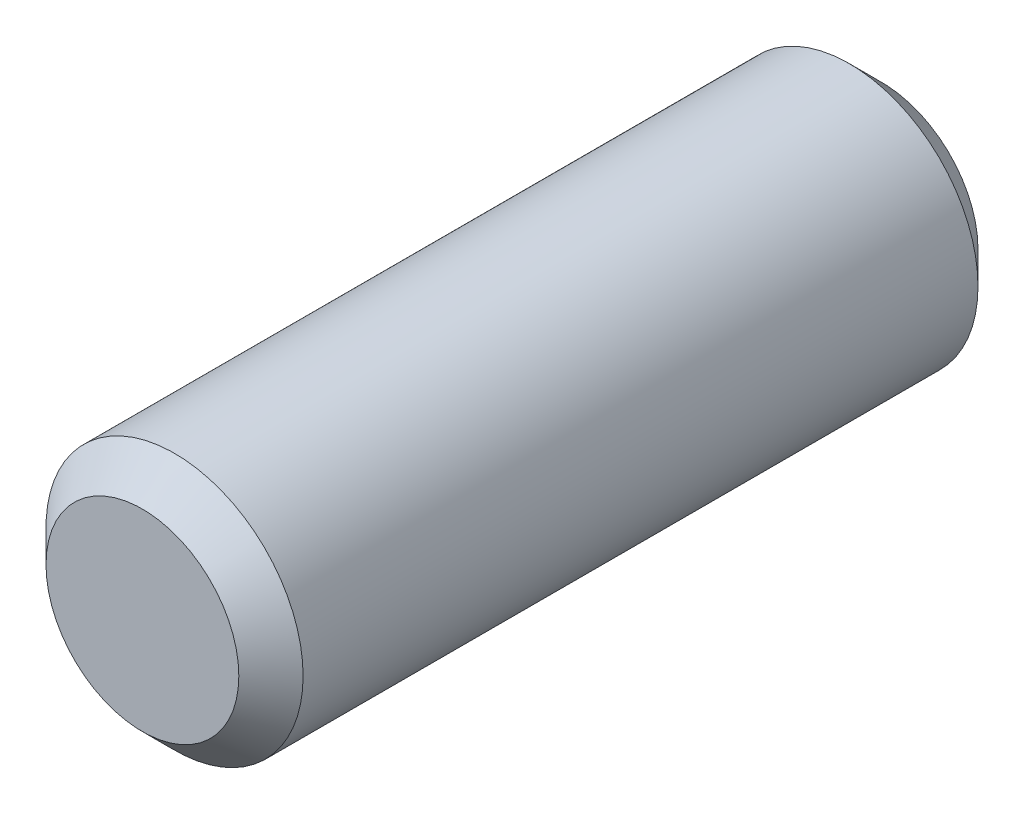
from build123d import *

# Parameters (mm, degrees)
BOSS_EXTRU_1_DEPTH      = 11
BOSS_EXTRU_1_DEPTH_BACK = 12
ESQUISSE1_R             = 4
CHANFREIN1_SIZE         = 1


with BuildPart() as part:
    # Esquisse1 → Boss.-Extru.1 (new, two sides: drawn at the far end of the back side and taken through both)
    with BuildSketch(Plane.XY.offset(-BOSS_EXTRU_1_DEPTH_BACK)):
        Circle(ESQUISSE1_R)
    extrude(amount=BOSS_EXTRU_1_DEPTH + BOSS_EXTRU_1_DEPTH_BACK)

    # Chanfrein1
    chanfrein1_edges = [part.edges().sort_by_distance(p)[0] for p in [
        (-4, 0, -12),
        (-4, 0, 11),
    ]]
    chamfer(chanfrein1_edges, length=CHANFREIN1_SIZE)


solid = part.part
